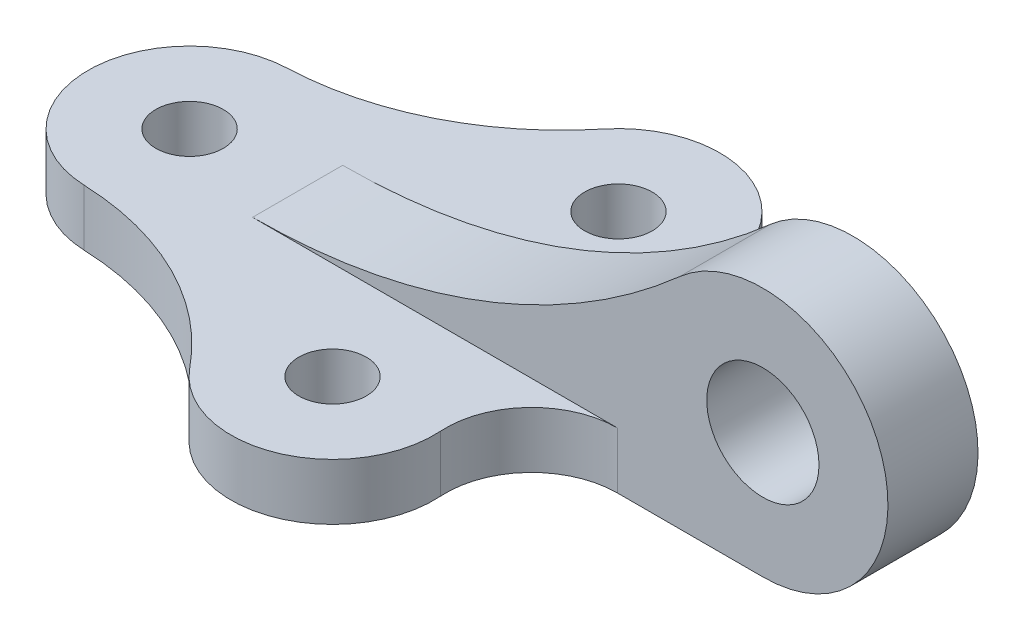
ISO-10303-21;
HEADER;
FILE_DESCRIPTION(('STEP AP214'),'2;1');
FILE_NAME('part.step','',(''),(''),'','','');
FILE_SCHEMA(('AUTOMOTIVE_DESIGN { 1 0 10303 214 1 1 1 1 }'));
ENDSEC;
DATA;
#1=APPLICATION_CONTEXT('core data for automotive mechanical design processes');
#2=APPLICATION_PROTOCOL_DEFINITION('international standard','automotive_design',2000,#1);
#3=PRODUCT_CONTEXT('',#1,'mechanical');
#4=PRODUCT('Part','Part','',(#3));
#5=PRODUCT_RELATED_PRODUCT_CATEGORY('part','',(#4));
#6=PRODUCT_DEFINITION_FORMATION('','',#4);
#7=PRODUCT_DEFINITION_CONTEXT('part definition',#1,'design');
#8=PRODUCT_DEFINITION('design','',#6,#7);
#9=PRODUCT_DEFINITION_SHAPE('','',#8);
#10=(LENGTH_UNIT() NAMED_UNIT(*) SI_UNIT(.MILLI.,.METRE.));
#11=(NAMED_UNIT(*) PLANE_ANGLE_UNIT() SI_UNIT($,.RADIAN.));
#12=(NAMED_UNIT(*) SI_UNIT($,.STERADIAN.) SOLID_ANGLE_UNIT());
#13=UNCERTAINTY_MEASURE_WITH_UNIT(LENGTH_MEASURE(1.E-05),#10,'distance_accuracy_value','');
#14=(GEOMETRIC_REPRESENTATION_CONTEXT(3) GLOBAL_UNCERTAINTY_ASSIGNED_CONTEXT((#13)) GLOBAL_UNIT_ASSIGNED_CONTEXT((#10,
#11,#12)) REPRESENTATION_CONTEXT('',''));
#15=CARTESIAN_POINT('',(0.,0.,0.));
#16=DIRECTION('',(0.,0.,1.));
#17=DIRECTION('',(1.,0.,0.));
#18=AXIS2_PLACEMENT_3D('',#15,#16,#17);
#19=CARTESIAN_POINT('',(84.0038822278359,10.0076,-23.241));
#20=DIRECTION('',(0.,1.,0.));
#21=DIRECTION('',(0.,0.,1.));
#22=AXIS2_PLACEMENT_3D('',#19,#20,#21);
#23=PLANE('',#22);
#24=DIRECTION('',(1.,0.,0.));
#25=VECTOR('',#24,1.);
#26=CARTESIAN_POINT('',(84.0038822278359,10.0076,8.001));
#27=LINE('',#26,#25);
#28=CARTESIAN_POINT('',(19.2006101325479,10.0076,8.001));
#29=VERTEX_POINT('',#28);
#30=CARTESIAN_POINT('',(84.0038822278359,10.0076,8.001));
#31=VERTEX_POINT('',#30);
#32=EDGE_CURVE('E178',#29,#31,#27,.T.);
#33=ORIENTED_EDGE('',*,*,#32,.F.);
#34=DIRECTION('',(0.,0.,-1.));
#35=VECTOR('',#34,1.);
#36=CARTESIAN_POINT('',(19.2006101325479,10.0076,8.001));
#37=LINE('',#36,#35);
#38=CARTESIAN_POINT('',(19.2006101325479,10.0076,-8.001));
#39=VERTEX_POINT('',#38);
#40=EDGE_CURVE('E208',#29,#39,#37,.T.);
#41=ORIENTED_EDGE('',*,*,#40,.T.);
#42=DIRECTION('',(1.,0.,0.));
#43=VECTOR('',#42,1.);
#44=CARTESIAN_POINT('',(84.0038822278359,10.0076,-8.001));
#45=LINE('',#44,#43);
#46=CARTESIAN_POINT('',(84.0038822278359,10.0076,-8.001));
#47=VERTEX_POINT('',#46);
#48=EDGE_CURVE('E201',#39,#47,#45,.T.);
#49=ORIENTED_EDGE('',*,*,#48,.T.);
#50=CARTESIAN_POINT('',(84.0038822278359,10.0076,-23.241));
#51=DIRECTION('',(0.,-1.,0.));
#52=DIRECTION('',(0.,0.,1.));
#53=AXIS2_PLACEMENT_3D('',#50,#51,#52);
#54=CIRCLE('',#53,15.24);
#55=CARTESIAN_POINT('',(68.7959972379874,10.0076,-24.2298549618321));
#56=VERTEX_POINT('',#55);
#57=EDGE_CURVE('E152',#47,#56,#54,.T.);
#58=ORIENTED_EDGE('',*,*,#57,.T.);
#59=CARTESIAN_POINT('',(50.8,10.0076,-25.4));
#60=DIRECTION('',(0.,1.,0.));
#61=DIRECTION('',(0.,0.,1.));
#62=AXIS2_PLACEMENT_3D('',#59,#60,#61);
#63=CIRCLE('',#62,18.034);
#64=CARTESIAN_POINT('',(36.7986831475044,10.0076,-36.7661023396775));
#65=VERTEX_POINT('',#64);
#66=EDGE_CURVE('E96',#56,#65,#63,.T.);
#67=ORIENTED_EDGE('',*,*,#66,.T.);
#68=CARTESIAN_POINT('',(-2.641646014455,10.0076,-68.78329202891));
#69=DIRECTION('',(0.,-1.,0.));
#70=DIRECTION('',(0.,0.,1.));
#71=AXIS2_PLACEMENT_3D('',#68,#69,#70);
#72=CIRCLE('',#71,50.8);
#73=CARTESIAN_POINT('',(-0.692091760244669,10.0076,-18.020714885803));
#74=VERTEX_POINT('',#73);
#75=EDGE_CURVE('E114',#65,#74,#72,.T.);
#76=ORIENTED_EDGE('',*,*,#75,.T.);
#77=CARTESIAN_POINT('',(0.,10.0076,0.));
#78=DIRECTION('',(0.,1.,0.));
#79=DIRECTION('',(0.,0.,1.));
#80=AXIS2_PLACEMENT_3D('',#77,#78,#79);
#81=CIRCLE('',#80,18.034);
#82=CARTESIAN_POINT('',(-0.692091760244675,10.0076,18.020714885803));
#83=VERTEX_POINT('',#82);
#84=EDGE_CURVE('E106',#74,#83,#81,.T.);
#85=ORIENTED_EDGE('',*,*,#84,.T.);
#86=CARTESIAN_POINT('',(-2.641646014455,10.0076,68.78329202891));
#87=DIRECTION('',(0.,-1.,0.));
#88=DIRECTION('',(0.,0.,-1.));
#89=AXIS2_PLACEMENT_3D('',#86,#87,#88);
#90=CIRCLE('',#89,50.8);
#91=CARTESIAN_POINT('',(36.7986831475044,10.0076,36.7661023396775));
#92=VERTEX_POINT('',#91);
#93=EDGE_CURVE('E111',#83,#92,#90,.T.);
#94=ORIENTED_EDGE('',*,*,#93,.T.);
#95=CARTESIAN_POINT('',(50.8,10.0076,25.4));
#96=DIRECTION('',(0.,1.,0.));
#97=DIRECTION('',(0.,0.,-1.));
#98=AXIS2_PLACEMENT_3D('',#95,#96,#97);
#99=CIRCLE('',#98,18.034);
#100=CARTESIAN_POINT('',(68.7959972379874,10.0076,24.2298549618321));
#101=VERTEX_POINT('',#100);
#102=EDGE_CURVE('E54',#92,#101,#99,.T.);
#103=ORIENTED_EDGE('',*,*,#102,.T.);
#104=CARTESIAN_POINT('',(84.0038822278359,10.0076,23.241));
#105=DIRECTION('',(0.,-1.,0.));
#106=DIRECTION('',(0.,0.,-1.));
#107=AXIS2_PLACEMENT_3D('',#104,#105,#106);
#108=CIRCLE('',#107,15.24);
#109=EDGE_CURVE('E131',#101,#31,#108,.T.);
#110=ORIENTED_EDGE('',*,*,#109,.T.);
#111=EDGE_LOOP('',(#33,#41,#49,#58,#67,#76,#85,#94,#103,#110));
#112=FACE_BOUND('',#111,.T.);
#113=CARTESIAN_POINT('',(50.8,10.0076,-25.4));
#114=DIRECTION('',(0.,1.,0.));
#115=DIRECTION('',(0.,0.,1.));
#116=AXIS2_PLACEMENT_3D('',#113,#114,#115);
#117=CIRCLE('',#116,5.9944);
#118=CARTESIAN_POINT('',(50.8,10.0076,-19.4056));
#119=VERTEX_POINT('',#118);
#120=EDGE_CURVE('E232',#119,#119,#117,.T.);
#121=ORIENTED_EDGE('',*,*,#120,.F.);
#122=EDGE_LOOP('',(#121));
#123=FACE_BOUND('',#122,.T.);
#124=CARTESIAN_POINT('',(0.,10.0076,0.));
#125=DIRECTION('',(0.,1.,0.));
#126=DIRECTION('',(0.,0.,1.));
#127=AXIS2_PLACEMENT_3D('',#124,#125,#126);
#128=CIRCLE('',#127,5.9944);
#129=CARTESIAN_POINT('',(0.,10.0076,5.9944));
#130=VERTEX_POINT('',#129);
#131=EDGE_CURVE('E141',#130,#130,#128,.T.);
#132=ORIENTED_EDGE('',*,*,#131,.F.);
#133=EDGE_LOOP('',(#132));
#134=FACE_BOUND('',#133,.T.);
#135=CARTESIAN_POINT('',(50.8,10.0076,25.4));
#136=DIRECTION('',(0.,1.,0.));
#137=DIRECTION('',(0.,0.,-1.));
#138=AXIS2_PLACEMENT_3D('',#135,#136,#137);
#139=CIRCLE('',#138,5.9944);
#140=CARTESIAN_POINT('',(50.8,10.0076,19.4056));
#141=VERTEX_POINT('',#140);
#142=EDGE_CURVE('E226',#141,#141,#139,.T.);
#143=ORIENTED_EDGE('',*,*,#142,.F.);
#144=EDGE_LOOP('',(#143));
#145=FACE_BOUND('',#144,.T.);
#146=ADVANCED_FACE('F37',(#112,#123,#134,#145),#23,.T.);
#147=CARTESIAN_POINT('',(84.0038822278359,0.,-23.241));
#148=DIRECTION('',(0.,1.,0.));
#149=DIRECTION('',(0.,0.,1.));
#150=AXIS2_PLACEMENT_3D('',#147,#148,#149);
#151=PLANE('',#150);
#152=DIRECTION('',(1.,0.,0.));
#153=VECTOR('',#152,1.);
#154=CARTESIAN_POINT('',(19.2006101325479,0.,8.001));
#155=LINE('',#154,#153);
#156=CARTESIAN_POINT('',(84.0038822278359,0.,8.001));
#157=VERTEX_POINT('',#156);
#158=CARTESIAN_POINT('',(109.855,0.,8.001));
#159=VERTEX_POINT('',#158);
#160=EDGE_CURVE('E408',#157,#159,#155,.T.);
#161=ORIENTED_EDGE('',*,*,#160,.F.);
#162=CARTESIAN_POINT('',(84.0038822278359,0.,23.241));
#163=DIRECTION('',(0.,-1.,0.));
#164=DIRECTION('',(0.,0.,-1.));
#165=AXIS2_PLACEMENT_3D('',#162,#163,#164);
#166=CIRCLE('',#165,15.24);
#167=CARTESIAN_POINT('',(68.7959972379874,0.,24.2298549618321));
#168=VERTEX_POINT('',#167);
#169=EDGE_CURVE('E149',#168,#157,#166,.T.);
#170=ORIENTED_EDGE('',*,*,#169,.F.);
#171=CARTESIAN_POINT('',(50.8,0.,25.4));
#172=DIRECTION('',(0.,1.,0.));
#173=DIRECTION('',(0.,0.,-1.));
#174=AXIS2_PLACEMENT_3D('',#171,#172,#173);
#175=CIRCLE('',#174,18.034);
#176=CARTESIAN_POINT('',(36.7986831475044,0.,36.7661023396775));
#177=VERTEX_POINT('',#176);
#178=EDGE_CURVE('E80',#177,#168,#175,.T.);
#179=ORIENTED_EDGE('',*,*,#178,.F.);
#180=CARTESIAN_POINT('',(-2.641646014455,0.,68.78329202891));
#181=DIRECTION('',(0.,-1.,0.));
#182=DIRECTION('',(0.,0.,-1.));
#183=AXIS2_PLACEMENT_3D('',#180,#181,#182);
#184=CIRCLE('',#183,50.8);
#185=CARTESIAN_POINT('',(-0.692091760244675,0.,18.020714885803));
#186=VERTEX_POINT('',#185);
#187=EDGE_CURVE('E146',#186,#177,#184,.T.);
#188=ORIENTED_EDGE('',*,*,#187,.F.);
#189=CARTESIAN_POINT('',(0.,0.,0.));
#190=DIRECTION('',(0.,1.,0.));
#191=DIRECTION('',(0.,0.,1.));
#192=AXIS2_PLACEMENT_3D('',#189,#190,#191);
#193=CIRCLE('',#192,18.034);
#194=CARTESIAN_POINT('',(-0.692091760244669,0.,-18.020714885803));
#195=VERTEX_POINT('',#194);
#196=EDGE_CURVE('E123',#195,#186,#193,.T.);
#197=ORIENTED_EDGE('',*,*,#196,.F.);
#198=CARTESIAN_POINT('',(-2.641646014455,0.,-68.78329202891));
#199=DIRECTION('',(0.,-1.,0.));
#200=DIRECTION('',(0.,0.,1.));
#201=AXIS2_PLACEMENT_3D('',#198,#199,#200);
#202=CIRCLE('',#201,50.8);
#203=CARTESIAN_POINT('',(36.7986831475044,0.,-36.7661023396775));
#204=VERTEX_POINT('',#203);
#205=EDGE_CURVE('E143',#204,#195,#202,.T.);
#206=ORIENTED_EDGE('',*,*,#205,.F.);
#207=CARTESIAN_POINT('',(50.8,0.,-25.4));
#208=DIRECTION('',(0.,1.,0.));
#209=DIRECTION('',(0.,0.,1.));
#210=AXIS2_PLACEMENT_3D('',#207,#208,#209);
#211=CIRCLE('',#210,18.034);
#212=CARTESIAN_POINT('',(68.7959972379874,0.,-24.2298549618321));
#213=VERTEX_POINT('',#212);
#214=EDGE_CURVE('E140',#213,#204,#211,.T.);
#215=ORIENTED_EDGE('',*,*,#214,.F.);
#216=CARTESIAN_POINT('',(84.0038822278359,0.,-23.241));
#217=DIRECTION('',(0.,-1.,0.));
#218=DIRECTION('',(0.,0.,1.));
#219=AXIS2_PLACEMENT_3D('',#216,#217,#218);
#220=CIRCLE('',#219,15.24);
#221=CARTESIAN_POINT('',(84.0038822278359,0.,-8.001));
#222=VERTEX_POINT('',#221);
#223=EDGE_CURVE('E137',#222,#213,#220,.T.);
#224=ORIENTED_EDGE('',*,*,#223,.F.);
#225=DIRECTION('',(1.,0.,0.));
#226=VECTOR('',#225,1.);
#227=CARTESIAN_POINT('',(19.2006101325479,0.,-8.001));
#228=LINE('',#227,#226);
#229=CARTESIAN_POINT('',(109.855,0.,-8.001));
#230=VERTEX_POINT('',#229);
#231=EDGE_CURVE('E88',#222,#230,#228,.T.);
#232=ORIENTED_EDGE('',*,*,#231,.T.);
#233=DIRECTION('',(0.,0.,-1.));
#234=VECTOR('',#233,1.);
#235=CARTESIAN_POINT('',(109.855,0.,8.001));
#236=LINE('',#235,#234);
#237=EDGE_CURVE('E218',#159,#230,#236,.T.);
#238=ORIENTED_EDGE('',*,*,#237,.F.);
#239=EDGE_LOOP('',(#161,#170,#179,#188,#197,#206,#215,#224,#232,#238));
#240=FACE_BOUND('',#239,.T.);
#241=CARTESIAN_POINT('',(0.,0.,0.));
#242=DIRECTION('',(0.,1.,0.));
#243=DIRECTION('',(0.,0.,1.));
#244=AXIS2_PLACEMENT_3D('',#241,#242,#243);
#245=CIRCLE('',#244,5.9944);
#246=CARTESIAN_POINT('',(0.,0.,5.9944));
#247=VERTEX_POINT('',#246);
#248=EDGE_CURVE('E235',#247,#247,#245,.T.);
#249=ORIENTED_EDGE('',*,*,#248,.T.);
#250=EDGE_LOOP('',(#249));
#251=FACE_BOUND('',#250,.T.);
#252=CARTESIAN_POINT('',(50.8,0.,-25.4));
#253=DIRECTION('',(0.,1.,0.));
#254=DIRECTION('',(0.,0.,1.));
#255=AXIS2_PLACEMENT_3D('',#252,#253,#254);
#256=CIRCLE('',#255,5.9944);
#257=CARTESIAN_POINT('',(50.8,0.,-19.4056));
#258=VERTEX_POINT('',#257);
#259=EDGE_CURVE('E229',#258,#258,#256,.T.);
#260=ORIENTED_EDGE('',*,*,#259,.T.);
#261=EDGE_LOOP('',(#260));
#262=FACE_BOUND('',#261,.T.);
#263=CARTESIAN_POINT('',(50.8,0.,25.4));
#264=DIRECTION('',(0.,1.,0.));
#265=DIRECTION('',(0.,0.,-1.));
#266=AXIS2_PLACEMENT_3D('',#263,#264,#265);
#267=CIRCLE('',#266,5.9944);
#268=CARTESIAN_POINT('',(50.8,0.,19.4056));
#269=VERTEX_POINT('',#268);
#270=EDGE_CURVE('E225',#269,#269,#267,.T.);
#271=ORIENTED_EDGE('',*,*,#270,.T.);
#272=EDGE_LOOP('',(#271));
#273=FACE_BOUND('',#272,.T.);
#274=ADVANCED_FACE('F166',(#240,#251,#262,#273),#151,.F.);
#275=CARTESIAN_POINT('',(84.0038822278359,10.0076,-23.241));
#276=DIRECTION('',(0.,-1.,0.));
#277=DIRECTION('',(0.,0.,-1.));
#278=AXIS2_PLACEMENT_3D('',#275,#276,#277);
#279=CYLINDRICAL_SURFACE('',#278,15.24);
#280=ORIENTED_EDGE('',*,*,#223,.T.);
#281=DIRECTION('',(0.,-1.,0.));
#282=VECTOR('',#281,1.);
#283=CARTESIAN_POINT('',(68.7959972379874,10.0076,-24.2298549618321));
#284=LINE('',#283,#282);
#285=EDGE_CURVE('E11',#56,#213,#284,.T.);
#286=ORIENTED_EDGE('',*,*,#285,.F.);
#287=ORIENTED_EDGE('',*,*,#57,.F.);
#288=DIRECTION('',(0.,-1.,0.));
#289=VECTOR('',#288,1.);
#290=CARTESIAN_POINT('',(84.0038822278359,10.0076,-8.001));
#291=LINE('',#290,#289);
#292=EDGE_CURVE('E136',#47,#222,#291,.T.);
#293=ORIENTED_EDGE('',*,*,#292,.T.);
#294=EDGE_LOOP('',(#280,#286,#287,#293));
#295=FACE_BOUND('',#294,.T.);
#296=ADVANCED_FACE('F39',(#295),#279,.F.);
#297=CARTESIAN_POINT('',(50.8,10.0076,-25.4));
#298=DIRECTION('',(0.,-1.,0.));
#299=DIRECTION('',(0.,0.,-1.));
#300=AXIS2_PLACEMENT_3D('',#297,#298,#299);
#301=CYLINDRICAL_SURFACE('',#300,18.034);
#302=ORIENTED_EDGE('',*,*,#214,.T.);
#303=DIRECTION('',(0.,-1.,0.));
#304=VECTOR('',#303,1.);
#305=CARTESIAN_POINT('',(36.7986831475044,10.0076,-36.7661023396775));
#306=LINE('',#305,#304);
#307=EDGE_CURVE('E46',#65,#204,#306,.T.);
#308=ORIENTED_EDGE('',*,*,#307,.F.);
#309=ORIENTED_EDGE('',*,*,#66,.F.);
#310=ORIENTED_EDGE('',*,*,#285,.T.);
#311=EDGE_LOOP('',(#302,#308,#309,#310));
#312=FACE_BOUND('',#311,.T.);
#313=ADVANCED_FACE('F245',(#312),#301,.T.);
#314=CARTESIAN_POINT('',(-2.641646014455,10.0076,-68.78329202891));
#315=DIRECTION('',(0.,-1.,0.));
#316=DIRECTION('',(0.,0.,-1.));
#317=AXIS2_PLACEMENT_3D('',#314,#315,#316);
#318=CYLINDRICAL_SURFACE('',#317,50.8);
#319=ORIENTED_EDGE('',*,*,#205,.T.);
#320=DIRECTION('',(0.,-1.,0.));
#321=VECTOR('',#320,1.);
#322=CARTESIAN_POINT('',(-0.692091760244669,10.0076,-18.020714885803));
#323=LINE('',#322,#321);
#324=EDGE_CURVE('E126',#74,#195,#323,.T.);
#325=ORIENTED_EDGE('',*,*,#324,.F.);
#326=ORIENTED_EDGE('',*,*,#75,.F.);
#327=ORIENTED_EDGE('',*,*,#307,.T.);
#328=EDGE_LOOP('',(#319,#325,#326,#327));
#329=FACE_BOUND('',#328,.T.);
#330=ADVANCED_FACE('F163',(#329),#318,.F.);
#331=CARTESIAN_POINT('',(0.,10.0076,0.));
#332=DIRECTION('',(0.,-1.,0.));
#333=DIRECTION('',(0.,0.,-1.));
#334=AXIS2_PLACEMENT_3D('',#331,#332,#333);
#335=CYLINDRICAL_SURFACE('',#334,18.034);
#336=ORIENTED_EDGE('',*,*,#196,.T.);
#337=DIRECTION('',(0.,-1.,0.));
#338=VECTOR('',#337,1.);
#339=CARTESIAN_POINT('',(-0.692091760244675,10.0076,18.020714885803));
#340=LINE('',#339,#338);
#341=EDGE_CURVE('E120',#83,#186,#340,.T.);
#342=ORIENTED_EDGE('',*,*,#341,.F.);
#343=ORIENTED_EDGE('',*,*,#84,.F.);
#344=ORIENTED_EDGE('',*,*,#324,.T.);
#345=EDGE_LOOP('',(#336,#342,#343,#344));
#346=FACE_BOUND('',#345,.T.);
#347=ADVANCED_FACE('F121',(#346),#335,.T.);
#348=CARTESIAN_POINT('',(-2.641646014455,10.0076,68.78329202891));
#349=DIRECTION('',(0.,-1.,0.));
#350=DIRECTION('',(0.,0.,-1.));
#351=AXIS2_PLACEMENT_3D('',#348,#349,#350);
#352=CYLINDRICAL_SURFACE('',#351,50.8);
#353=ORIENTED_EDGE('',*,*,#187,.T.);
#354=DIRECTION('',(0.,-1.,0.));
#355=VECTOR('',#354,1.);
#356=CARTESIAN_POINT('',(36.7986831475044,10.0076,36.7661023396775));
#357=LINE('',#356,#355);
#358=EDGE_CURVE('E127',#92,#177,#357,.T.);
#359=ORIENTED_EDGE('',*,*,#358,.F.);
#360=ORIENTED_EDGE('',*,*,#93,.F.);
#361=ORIENTED_EDGE('',*,*,#341,.T.);
#362=EDGE_LOOP('',(#353,#359,#360,#361));
#363=FACE_BOUND('',#362,.T.);
#364=ADVANCED_FACE('F129',(#363),#352,.F.);
#365=CARTESIAN_POINT('',(50.8,10.0076,25.4));
#366=DIRECTION('',(0.,-1.,0.));
#367=DIRECTION('',(0.,0.,-1.));
#368=AXIS2_PLACEMENT_3D('',#365,#366,#367);
#369=CYLINDRICAL_SURFACE('',#368,18.034);
#370=ORIENTED_EDGE('',*,*,#178,.T.);
#371=DIRECTION('',(0.,-1.,0.));
#372=VECTOR('',#371,1.);
#373=CARTESIAN_POINT('',(68.7959972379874,10.0076,24.2298549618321));
#374=LINE('',#373,#372);
#375=EDGE_CURVE('E157',#101,#168,#374,.T.);
#376=ORIENTED_EDGE('',*,*,#375,.F.);
#377=ORIENTED_EDGE('',*,*,#102,.F.);
#378=ORIENTED_EDGE('',*,*,#358,.T.);
#379=EDGE_LOOP('',(#370,#376,#377,#378));
#380=FACE_BOUND('',#379,.T.);
#381=ADVANCED_FACE('F170',(#380),#369,.T.);
#382=CARTESIAN_POINT('',(84.0038822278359,10.0076,23.241));
#383=DIRECTION('',(0.,-1.,0.));
#384=DIRECTION('',(0.,0.,-1.));
#385=AXIS2_PLACEMENT_3D('',#382,#383,#384);
#386=CYLINDRICAL_SURFACE('',#385,15.24);
#387=ORIENTED_EDGE('',*,*,#169,.T.);
#388=DIRECTION('',(0.,-1.,0.));
#389=VECTOR('',#388,1.);
#390=CARTESIAN_POINT('',(84.0038822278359,10.0076,8.001));
#391=LINE('',#390,#389);
#392=EDGE_CURVE('E154',#31,#157,#391,.T.);
#393=ORIENTED_EDGE('',*,*,#392,.F.);
#394=ORIENTED_EDGE('',*,*,#109,.F.);
#395=ORIENTED_EDGE('',*,*,#375,.T.);
#396=EDGE_LOOP('',(#387,#393,#394,#395));
#397=FACE_BOUND('',#396,.T.);
#398=ADVANCED_FACE('F174',(#397),#386,.F.);
#399=CARTESIAN_POINT('',(0.,10.0076,0.));
#400=DIRECTION('',(0.,-1.,0.));
#401=DIRECTION('',(0.,0.,-1.));
#402=AXIS2_PLACEMENT_3D('',#399,#400,#401);
#403=CYLINDRICAL_SURFACE('',#402,5.9944);
#404=ORIENTED_EDGE('',*,*,#131,.T.);
#405=EDGE_LOOP('',(#404));
#406=FACE_BOUND('',#405,.T.);
#407=ORIENTED_EDGE('',*,*,#248,.F.);
#408=EDGE_LOOP('',(#407));
#409=FACE_BOUND('',#408,.T.);
#410=ADVANCED_FACE('F259',(#406,#409),#403,.F.);
#411=CARTESIAN_POINT('',(50.8,10.0076,-25.4));
#412=DIRECTION('',(0.,-1.,0.));
#413=DIRECTION('',(0.,0.,-1.));
#414=AXIS2_PLACEMENT_3D('',#411,#412,#413);
#415=CYLINDRICAL_SURFACE('',#414,5.9944);
#416=ORIENTED_EDGE('',*,*,#120,.T.);
#417=EDGE_LOOP('',(#416));
#418=FACE_BOUND('',#417,.T.);
#419=ORIENTED_EDGE('',*,*,#259,.F.);
#420=EDGE_LOOP('',(#419));
#421=FACE_BOUND('',#420,.T.);
#422=ADVANCED_FACE('F293',(#418,#421),#415,.F.);
#423=CARTESIAN_POINT('',(50.8,10.0076,25.4));
#424=DIRECTION('',(0.,-1.,0.));
#425=DIRECTION('',(0.,0.,-1.));
#426=AXIS2_PLACEMENT_3D('',#423,#424,#425);
#427=CYLINDRICAL_SURFACE('',#426,5.9944);
#428=ORIENTED_EDGE('',*,*,#142,.T.);
#429=EDGE_LOOP('',(#428));
#430=FACE_BOUND('',#429,.T.);
#431=ORIENTED_EDGE('',*,*,#270,.F.);
#432=EDGE_LOOP('',(#431));
#433=FACE_BOUND('',#432,.T.);
#434=ADVANCED_FACE('F300',(#430,#433),#427,.F.);
#435=CARTESIAN_POINT('',(19.2006101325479,124.3076,8.001));
#436=DIRECTION('',(0.,0.,1.));
#437=DIRECTION('',(1.,0.,0.));
#438=AXIS2_PLACEMENT_3D('',#435,#436,#437);
#439=PLANE('',#438);
#440=CARTESIAN_POINT('',(19.2006101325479,124.3076,8.001));
#441=DIRECTION('',(0.,0.,-1.));
#442=DIRECTION('',(1.,0.,0.));
#443=AXIS2_PLACEMENT_3D('',#440,#441,#442);
#444=CIRCLE('',#443,114.3);
#445=CARTESIAN_POINT('',(95.0973086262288,38.8430976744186,8.001));
#446=VERTEX_POINT('',#445);
#447=EDGE_CURVE('E406',#446,#29,#444,.T.);
#448=ORIENTED_EDGE('',*,*,#447,.T.);
#449=ORIENTED_EDGE('',*,*,#32,.T.);
#450=ORIENTED_EDGE('',*,*,#392,.T.);
#451=ORIENTED_EDGE('',*,*,#160,.T.);
#452=CARTESIAN_POINT('',(109.855,22.225,8.001));
#453=DIRECTION('',(0.,0.,1.));
#454=DIRECTION('',(1.,0.,0.));
#455=AXIS2_PLACEMENT_3D('',#452,#453,#454);
#456=CIRCLE('',#455,22.225);
#457=EDGE_CURVE('E410',#159,#446,#456,.T.);
#458=ORIENTED_EDGE('',*,*,#457,.T.);
#459=EDGE_LOOP('',(#448,#449,#450,#451,#458));
#460=FACE_BOUND('',#459,.T.);
#461=CARTESIAN_POINT('',(109.855,22.225,8.001));
#462=DIRECTION('',(0.,0.,1.));
#463=DIRECTION('',(1.,0.,0.));
#464=AXIS2_PLACEMENT_3D('',#461,#462,#463);
#465=CIRCLE('',#464,9.96949999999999);
#466=CARTESIAN_POINT('',(119.8245,22.225,8.001));
#467=VERTEX_POINT('',#466);
#468=EDGE_CURVE('E397',#467,#467,#465,.T.);
#469=ORIENTED_EDGE('',*,*,#468,.F.);
#470=EDGE_LOOP('',(#469));
#471=FACE_BOUND('',#470,.T.);
#472=ADVANCED_FACE('F307',(#460,#471),#439,.T.);
#473=CARTESIAN_POINT('',(19.2006101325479,124.3076,8.001));
#474=DIRECTION('',(0.,0.,-1.));
#475=DIRECTION('',(-1.,0.,0.));
#476=AXIS2_PLACEMENT_3D('',#473,#474,#475);
#477=CYLINDRICAL_SURFACE('',#476,114.3);
#478=DIRECTION('',(0.,0.,-1.));
#479=VECTOR('',#478,1.);
#480=CARTESIAN_POINT('',(95.0973086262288,38.8430976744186,8.001));
#481=LINE('',#480,#479);
#482=CARTESIAN_POINT('',(95.0973086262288,38.8430976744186,-8.001));
#483=VERTEX_POINT('',#482);
#484=EDGE_CURVE('E215',#446,#483,#481,.T.);
#485=ORIENTED_EDGE('',*,*,#484,.T.);
#486=CARTESIAN_POINT('',(19.2006101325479,124.3076,-8.001));
#487=DIRECTION('',(0.,0.,-1.));
#488=DIRECTION('',(1.,0.,0.));
#489=AXIS2_PLACEMENT_3D('',#486,#487,#488);
#490=CIRCLE('',#489,114.3);
#491=EDGE_CURVE('E205',#483,#39,#490,.T.);
#492=ORIENTED_EDGE('',*,*,#491,.T.);
#493=ORIENTED_EDGE('',*,*,#40,.F.);
#494=ORIENTED_EDGE('',*,*,#447,.F.);
#495=EDGE_LOOP('',(#485,#492,#493,#494));
#496=FACE_BOUND('',#495,.T.);
#497=ADVANCED_FACE('F212',(#496),#477,.F.);
#498=CARTESIAN_POINT('',(109.855,22.225,8.001));
#499=DIRECTION('',(0.,0.,-1.));
#500=DIRECTION('',(-1.,0.,0.));
#501=AXIS2_PLACEMENT_3D('',#498,#499,#500);
#502=CYLINDRICAL_SURFACE('',#501,22.225);
#503=ORIENTED_EDGE('',*,*,#237,.T.);
#504=CARTESIAN_POINT('',(109.855,22.225,-8.001));
#505=DIRECTION('',(0.,0.,1.));
#506=DIRECTION('',(1.,0.,0.));
#507=AXIS2_PLACEMENT_3D('',#504,#505,#506);
#508=CIRCLE('',#507,22.225);
#509=EDGE_CURVE('E403',#230,#483,#508,.T.);
#510=ORIENTED_EDGE('',*,*,#509,.T.);
#511=ORIENTED_EDGE('',*,*,#484,.F.);
#512=ORIENTED_EDGE('',*,*,#457,.F.);
#513=EDGE_LOOP('',(#503,#510,#511,#512));
#514=FACE_BOUND('',#513,.T.);
#515=ADVANCED_FACE('F320',(#514),#502,.T.);
#516=CARTESIAN_POINT('',(109.855,22.225,8.001));
#517=DIRECTION('',(0.,0.,-1.));
#518=DIRECTION('',(-1.,0.,0.));
#519=AXIS2_PLACEMENT_3D('',#516,#517,#518);
#520=CYLINDRICAL_SURFACE('',#519,9.96949999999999);
#521=ORIENTED_EDGE('',*,*,#468,.T.);
#522=EDGE_LOOP('',(#521));
#523=FACE_BOUND('',#522,.T.);
#524=CARTESIAN_POINT('',(109.855,22.225,-8.001));
#525=DIRECTION('',(0.,0.,1.));
#526=DIRECTION('',(1.,0.,0.));
#527=AXIS2_PLACEMENT_3D('',#524,#525,#526);
#528=CIRCLE('',#527,9.96949999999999);
#529=CARTESIAN_POINT('',(119.8245,22.225,-8.001));
#530=VERTEX_POINT('',#529);
#531=EDGE_CURVE('E216',#530,#530,#528,.T.);
#532=ORIENTED_EDGE('',*,*,#531,.F.);
#533=EDGE_LOOP('',(#532));
#534=FACE_BOUND('',#533,.T.);
#535=ADVANCED_FACE('F327',(#523,#534),#520,.F.);
#536=CARTESIAN_POINT('',(19.2006101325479,124.3076,-8.001));
#537=DIRECTION('',(0.,0.,1.));
#538=DIRECTION('',(1.,0.,0.));
#539=AXIS2_PLACEMENT_3D('',#536,#537,#538);
#540=PLANE('',#539);
#541=ORIENTED_EDGE('',*,*,#48,.F.);
#542=ORIENTED_EDGE('',*,*,#491,.F.);
#543=ORIENTED_EDGE('',*,*,#509,.F.);
#544=ORIENTED_EDGE('',*,*,#231,.F.);
#545=ORIENTED_EDGE('',*,*,#292,.F.);
#546=EDGE_LOOP('',(#541,#542,#543,#544,#545));
#547=FACE_BOUND('',#546,.T.);
#548=ORIENTED_EDGE('',*,*,#531,.T.);
#549=EDGE_LOOP('',(#548));
#550=FACE_BOUND('',#549,.T.);
#551=ADVANCED_FACE('F203',(#547,#550),#540,.F.);
#552=CLOSED_SHELL('',(#146,#274,#296,#313,#330,#347,#364,#381,#398,#410,#422,#434,#472,#497,
#515,#535,#551));
#553=MANIFOLD_SOLID_BREP('B2',#552);
#554=ADVANCED_BREP_SHAPE_REPRESENTATION('',(#18,#553),#14);
#555=SHAPE_DEFINITION_REPRESENTATION(#9,#554);
ENDSEC;
END-ISO-10303-21;
